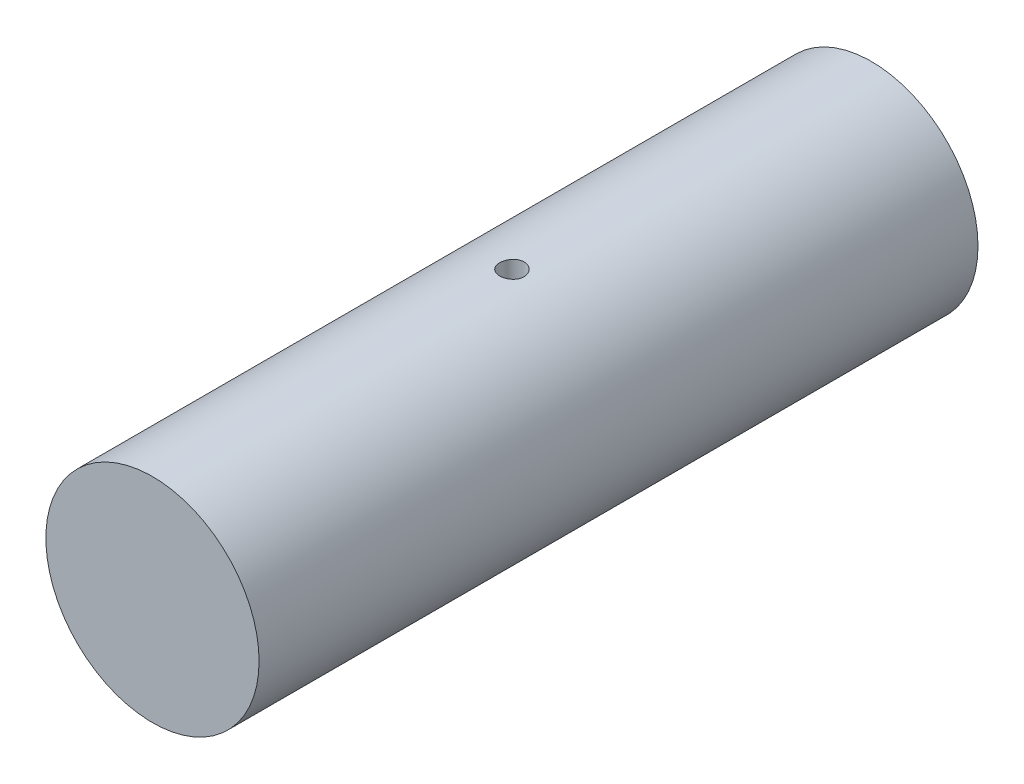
ISO-10303-21;
HEADER;
FILE_DESCRIPTION(('STEP AP214'),'2;1');
FILE_NAME('part.step','',(''),(''),'','','');
FILE_SCHEMA(('AUTOMOTIVE_DESIGN { 1 0 10303 214 1 1 1 1 }'));
ENDSEC;
DATA;
#1=APPLICATION_CONTEXT('core data for automotive mechanical design processes');
#2=APPLICATION_PROTOCOL_DEFINITION('international standard','automotive_design',2000,#1);
#3=PRODUCT_CONTEXT('',#1,'mechanical');
#4=PRODUCT('Part','Part','',(#3));
#5=PRODUCT_RELATED_PRODUCT_CATEGORY('part','',(#4));
#6=PRODUCT_DEFINITION_FORMATION('','',#4);
#7=PRODUCT_DEFINITION_CONTEXT('part definition',#1,'design');
#8=PRODUCT_DEFINITION('design','',#6,#7);
#9=PRODUCT_DEFINITION_SHAPE('','',#8);
#10=(LENGTH_UNIT() NAMED_UNIT(*) SI_UNIT(.MILLI.,.METRE.));
#11=(NAMED_UNIT(*) PLANE_ANGLE_UNIT() SI_UNIT($,.RADIAN.));
#12=(NAMED_UNIT(*) SI_UNIT($,.STERADIAN.) SOLID_ANGLE_UNIT());
#13=UNCERTAINTY_MEASURE_WITH_UNIT(LENGTH_MEASURE(1.E-05),#10,'distance_accuracy_value','');
#14=(GEOMETRIC_REPRESENTATION_CONTEXT(3) GLOBAL_UNCERTAINTY_ASSIGNED_CONTEXT((#13)) GLOBAL_UNIT_ASSIGNED_CONTEXT((#10,
#11,#12)) REPRESENTATION_CONTEXT('',''));
#15=CARTESIAN_POINT('',(0.,0.,0.));
#16=DIRECTION('',(0.,0.,1.));
#17=DIRECTION('',(1.,0.,0.));
#18=AXIS2_PLACEMENT_3D('',#15,#16,#17);
#19=CARTESIAN_POINT('',(0.,0.,118.));
#20=DIRECTION('',(0.,0.,-1.));
#21=DIRECTION('',(-1.,0.,0.));
#22=AXIS2_PLACEMENT_3D('',#19,#20,#21);
#23=CYLINDRICAL_SURFACE('',#22,17.5);
#24=CARTESIAN_POINT('',(0.,-17.5,61.));
#25=CARTESIAN_POINT('',(0.111949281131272,-17.4999985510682,60.9999951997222));
#26=CARTESIAN_POINT('',(0.223970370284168,-17.4989143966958,60.9905688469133));
#27=CARTESIAN_POINT('',(0.444900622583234,-17.4946937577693,60.9531111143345));
#28=CARTESIAN_POINT('',(0.553806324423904,-17.4915550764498,60.9250598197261));
#29=CARTESIAN_POINT('',(0.765274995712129,-17.4835792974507,60.8511849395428));
#30=CARTESIAN_POINT('',(0.867841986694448,-17.4787432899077,60.8053727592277));
#31=CARTESIAN_POINT('',(1.06381060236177,-17.4679120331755,60.6973002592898));
#32=CARTESIAN_POINT('',(1.15721390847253,-17.4619169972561,60.6350429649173));
#33=CARTESIAN_POINT('',(1.33265783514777,-17.4494069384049,60.4955382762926));
#34=CARTESIAN_POINT('',(1.41464987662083,-17.4428898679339,60.4182299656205));
#35=CARTESIAN_POINT('',(1.5645257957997,-17.4300869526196,60.2509482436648));
#36=CARTESIAN_POINT('',(1.63240898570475,-17.4238011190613,60.1609742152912));
#37=CARTESIAN_POINT('',(1.75231750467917,-17.4121519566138,59.970604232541));
#38=CARTESIAN_POINT('',(1.80429797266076,-17.4067912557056,59.870179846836));
#39=CARTESIAN_POINT('',(1.89063905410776,-17.3976257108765,59.6619560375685));
#40=CARTESIAN_POINT('',(1.92500022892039,-17.3938208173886,59.5541568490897));
#41=CARTESIAN_POINT('',(1.97498120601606,-17.3882168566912,59.3347441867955));
#42=CARTESIAN_POINT('',(1.99068245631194,-17.3864090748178,59.2231494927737));
#43=CARTESIAN_POINT('',(2.00314979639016,-17.3849772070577,58.9988954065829));
#44=CARTESIAN_POINT('',(1.99991652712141,-17.3853530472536,58.8862360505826));
#45=CARTESIAN_POINT('',(1.9746735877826,-17.3882379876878,58.6636154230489));
#46=CARTESIAN_POINT('',(1.95275327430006,-17.3907369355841,58.5536438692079));
#47=CARTESIAN_POINT('',(1.89089772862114,-17.3975706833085,58.3389506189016));
#48=CARTESIAN_POINT('',(1.85096218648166,-17.4019055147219,58.2342290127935));
#49=CARTESIAN_POINT('',(1.7541125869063,-17.4119342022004,58.0327285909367));
#50=CARTESIAN_POINT('',(1.697159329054,-17.4176311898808,57.9359687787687));
#51=CARTESIAN_POINT('',(1.5679190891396,-17.4297397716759,57.7533467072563));
#52=CARTESIAN_POINT('',(1.49563152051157,-17.4361513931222,57.6674848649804));
#53=CARTESIAN_POINT('',(1.33727766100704,-17.4490120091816,57.5085771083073));
#54=CARTESIAN_POINT('',(1.25113428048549,-17.455461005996,57.4356079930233));
#55=CARTESIAN_POINT('',(1.06778054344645,-17.4676349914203,57.3051537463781));
#56=CARTESIAN_POINT('',(0.970570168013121,-17.4733599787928,57.2476686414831));
#57=CARTESIAN_POINT('',(0.767785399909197,-17.4834436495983,57.1498155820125));
#58=CARTESIAN_POINT('',(0.662208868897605,-17.4878019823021,57.1094520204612));
#59=CARTESIAN_POINT('',(0.445716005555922,-17.4946579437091,57.0470466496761));
#60=CARTESIAN_POINT('',(0.334799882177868,-17.4971556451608,57.0250041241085));
#61=CARTESIAN_POINT('',(0.111440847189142,-17.4999995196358,56.9999651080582));
#62=CARTESIAN_POINT('',(-0.000990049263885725,-17.5003576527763,56.9968627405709));
#63=CARTESIAN_POINT('',(-0.224770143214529,-17.4989142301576,57.0095132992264));
#64=CARTESIAN_POINT('',(-0.336119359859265,-17.4971127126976,57.0252658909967));
#65=CARTESIAN_POINT('',(-0.554265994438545,-17.4915599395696,57.0750913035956));
#66=CARTESIAN_POINT('',(-0.661074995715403,-17.4878140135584,57.109114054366));
#67=CARTESIAN_POINT('',(-0.867470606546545,-17.4787921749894,57.1944622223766));
#68=CARTESIAN_POINT('',(-0.967057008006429,-17.4735162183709,57.2457881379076));
#69=CARTESIAN_POINT('',(-1.1566560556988,-17.4619935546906,57.3645447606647));
#70=CARTESIAN_POINT('',(-1.24662524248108,-17.4557427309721,57.4320444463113));
#71=CARTESIAN_POINT('',(-1.41399482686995,-17.4429836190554,57.5811343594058));
#72=CARTESIAN_POINT('',(-1.49139480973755,-17.4364753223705,57.6627250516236));
#73=CARTESIAN_POINT('',(-1.63180089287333,-17.4238982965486,57.8381453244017));
#74=CARTESIAN_POINT('',(-1.69473712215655,-17.4178317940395,57.9320310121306));
#75=CARTESIAN_POINT('',(-1.80394755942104,-17.4068606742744,58.1291019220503));
#76=CARTESIAN_POINT('',(-1.85022205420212,-17.4019560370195,58.2322869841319));
#77=CARTESIAN_POINT('',(-1.92468057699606,-17.3938786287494,58.4447957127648));
#78=CARTESIAN_POINT('',(-1.9529049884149,-17.3907019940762,58.5541050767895));
#79=CARTESIAN_POINT('',(-1.99059267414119,-17.3864287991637,58.7759500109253));
#80=CARTESIAN_POINT('',(-2.00005666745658,-17.385332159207,58.8884854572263));
#81=CARTESIAN_POINT('',(-1.99994314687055,-17.385345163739,59.1128933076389));
#82=CARTESIAN_POINT('',(-1.99047539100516,-17.3864420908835,59.2247657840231));
#83=CARTESIAN_POINT('',(-1.95299850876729,-17.3906913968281,59.445318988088));
#84=CARTESIAN_POINT('',(-1.92498937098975,-17.3938437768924,59.5539997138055));
#85=CARTESIAN_POINT('',(-1.85125733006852,-17.4018450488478,59.7650760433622));
#86=CARTESIAN_POINT('',(-1.80553879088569,-17.4066935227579,59.8674731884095));
#87=CARTESIAN_POINT('',(-1.69769666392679,-17.4175414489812,60.0631591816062));
#88=CARTESIAN_POINT('',(-1.63557300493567,-17.4235409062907,60.1564479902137));
#89=CARTESIAN_POINT('',(-1.496274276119,-17.4360565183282,60.3318311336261));
#90=CARTESIAN_POINT('',(-1.41901733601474,-17.4425753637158,60.4138602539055));
#91=CARTESIAN_POINT('',(-1.25181311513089,-17.4553710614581,60.5638342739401));
#92=CARTESIAN_POINT('',(-1.16186282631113,-17.4616478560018,60.6317758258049));
#93=CARTESIAN_POINT('',(-0.971500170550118,-17.4732739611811,60.751826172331));
#94=CARTESIAN_POINT('',(-0.871055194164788,-17.478620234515,60.8038835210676));
#95=CARTESIAN_POINT('',(-0.662847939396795,-17.4877513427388,60.8903202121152));
#96=CARTESIAN_POINT('',(-0.555093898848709,-17.4915379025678,60.9247190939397));
#97=CARTESIAN_POINT('',(-0.372298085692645,-17.4961924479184,60.9664711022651));
#98=CARTESIAN_POINT('',(-0.298416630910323,-17.4976134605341,60.9790267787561));
#99=CARTESIAN_POINT('',(-0.149700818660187,-17.499517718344,60.9957928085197));
#100=CARTESIAN_POINT('',(-0.0748664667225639,-17.5000009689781,61.0000032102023));
#101=CARTESIAN_POINT('',(0.,-17.5,61.));
#102=B_SPLINE_CURVE_WITH_KNOTS('',3,(#24,#25,#26,#27,#28,#29,#30,#31,#32,#33,#34,#35,#36,#37,
#38,#39,#40,#41,#42,#43,#44,#45,#46,#47,#48,#49,#50,#51,#52,#53,#54,#55,#56,#57,#58,#59,#60,#61,
#62,#63,#64,#65,#66,#67,#68,#69,#70,#71,#72,#73,#74,#75,#76,#77,#78,#79,#80,#81,#82,#83,#84,#85,
#86,#87,#88,#89,#90,#91,#92,#93,#94,#95,#96,#97,#98,#99,#100,#101),.UNSPECIFIED.,.T.,.F.,(4,2,2,
2,2,2,2,2,2,2,2,2,2,2,2,2,2,2,2,2,2,2,2,2,2,2,2,2,2,2,2,2,2,2,2,2,2,2,4),(0.,0.33557441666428,
0.671508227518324,1.00722667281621,1.34288340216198,1.67992799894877,2.01698902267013,
2.35499229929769,2.69298480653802,3.02949654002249,3.36599688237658,3.70089713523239,
4.03580315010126,4.37148664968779,4.7071829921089,5.04481612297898,5.38244983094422,
5.72017011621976,6.05787719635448,6.39369472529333,6.7295062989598,7.06440223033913,
7.39930780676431,7.73566795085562,8.07203919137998,8.41000271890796,8.74796042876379,
9.08515935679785,9.42234536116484,9.75758217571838,10.0928191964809,10.4279736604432,
10.763129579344,11.100151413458,11.4372532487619,11.7754355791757,12.1132428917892,
12.3376607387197,12.5620772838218),.UNSPECIFIED.);
#103=CARTESIAN_POINT('',(0.,-17.5,61.));
#104=VERTEX_POINT('',#103);
#105=EDGE_CURVE('E10',#104,#104,#102,.T.);
#106=ORIENTED_EDGE('',*,*,#105,.T.);
#107=EDGE_LOOP('',(#106));
#108=FACE_BOUND('',#107,.T.);
#109=CARTESIAN_POINT('',(0.,17.5,61.));
#110=CARTESIAN_POINT('',(-0.111949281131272,17.4999985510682,60.9999951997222));
#111=CARTESIAN_POINT('',(-0.223970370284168,17.4989143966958,60.9905688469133));
#112=CARTESIAN_POINT('',(-0.444900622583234,17.4946937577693,60.9531111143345));
#113=CARTESIAN_POINT('',(-0.553806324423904,17.4915550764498,60.9250598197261));
#114=CARTESIAN_POINT('',(-0.765274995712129,17.4835792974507,60.8511849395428));
#115=CARTESIAN_POINT('',(-0.867841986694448,17.4787432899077,60.8053727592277));
#116=CARTESIAN_POINT('',(-1.06381060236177,17.4679120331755,60.6973002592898));
#117=CARTESIAN_POINT('',(-1.15721390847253,17.4619169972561,60.6350429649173));
#118=CARTESIAN_POINT('',(-1.33265783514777,17.4494069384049,60.4955382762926));
#119=CARTESIAN_POINT('',(-1.41464987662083,17.4428898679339,60.4182299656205));
#120=CARTESIAN_POINT('',(-1.5645257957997,17.4300869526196,60.2509482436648));
#121=CARTESIAN_POINT('',(-1.63240898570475,17.4238011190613,60.1609742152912));
#122=CARTESIAN_POINT('',(-1.75231750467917,17.4121519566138,59.970604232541));
#123=CARTESIAN_POINT('',(-1.80429797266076,17.4067912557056,59.870179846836));
#124=CARTESIAN_POINT('',(-1.89063905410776,17.3976257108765,59.6619560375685));
#125=CARTESIAN_POINT('',(-1.92500022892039,17.3938208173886,59.5541568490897));
#126=CARTESIAN_POINT('',(-1.97498120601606,17.3882168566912,59.3347441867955));
#127=CARTESIAN_POINT('',(-1.99068245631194,17.3864090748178,59.2231494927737));
#128=CARTESIAN_POINT('',(-2.00314979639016,17.3849772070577,58.9988954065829));
#129=CARTESIAN_POINT('',(-1.99991652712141,17.3853530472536,58.8862360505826));
#130=CARTESIAN_POINT('',(-1.9746735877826,17.3882379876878,58.6636154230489));
#131=CARTESIAN_POINT('',(-1.95275327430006,17.3907369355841,58.5536438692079));
#132=CARTESIAN_POINT('',(-1.89089772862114,17.3975706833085,58.3389506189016));
#133=CARTESIAN_POINT('',(-1.85096218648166,17.4019055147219,58.2342290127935));
#134=CARTESIAN_POINT('',(-1.7541125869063,17.4119342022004,58.0327285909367));
#135=CARTESIAN_POINT('',(-1.697159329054,17.4176311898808,57.9359687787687));
#136=CARTESIAN_POINT('',(-1.5679190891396,17.4297397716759,57.7533467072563));
#137=CARTESIAN_POINT('',(-1.49563152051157,17.4361513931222,57.6674848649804));
#138=CARTESIAN_POINT('',(-1.33727766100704,17.4490120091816,57.5085771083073));
#139=CARTESIAN_POINT('',(-1.25113428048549,17.455461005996,57.4356079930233));
#140=CARTESIAN_POINT('',(-1.06778054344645,17.4676349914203,57.3051537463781));
#141=CARTESIAN_POINT('',(-0.970570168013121,17.4733599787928,57.2476686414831));
#142=CARTESIAN_POINT('',(-0.767785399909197,17.4834436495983,57.1498155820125));
#143=CARTESIAN_POINT('',(-0.662208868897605,17.4878019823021,57.1094520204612));
#144=CARTESIAN_POINT('',(-0.445716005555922,17.4946579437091,57.0470466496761));
#145=CARTESIAN_POINT('',(-0.334799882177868,17.4971556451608,57.0250041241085));
#146=CARTESIAN_POINT('',(-0.111440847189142,17.4999995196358,56.9999651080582));
#147=CARTESIAN_POINT('',(0.000990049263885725,17.5003576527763,56.9968627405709));
#148=CARTESIAN_POINT('',(0.224770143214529,17.4989142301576,57.0095132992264));
#149=CARTESIAN_POINT('',(0.336119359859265,17.4971127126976,57.0252658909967));
#150=CARTESIAN_POINT('',(0.554265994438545,17.4915599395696,57.0750913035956));
#151=CARTESIAN_POINT('',(0.661074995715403,17.4878140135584,57.109114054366));
#152=CARTESIAN_POINT('',(0.867470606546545,17.4787921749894,57.1944622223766));
#153=CARTESIAN_POINT('',(0.967057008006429,17.4735162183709,57.2457881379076));
#154=CARTESIAN_POINT('',(1.1566560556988,17.4619935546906,57.3645447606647));
#155=CARTESIAN_POINT('',(1.24662524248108,17.4557427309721,57.4320444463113));
#156=CARTESIAN_POINT('',(1.41399482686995,17.4429836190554,57.5811343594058));
#157=CARTESIAN_POINT('',(1.49139480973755,17.4364753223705,57.6627250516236));
#158=CARTESIAN_POINT('',(1.63180089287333,17.4238982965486,57.8381453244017));
#159=CARTESIAN_POINT('',(1.69473712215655,17.4178317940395,57.9320310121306));
#160=CARTESIAN_POINT('',(1.80394755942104,17.4068606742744,58.1291019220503));
#161=CARTESIAN_POINT('',(1.85022205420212,17.4019560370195,58.2322869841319));
#162=CARTESIAN_POINT('',(1.92468057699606,17.3938786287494,58.4447957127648));
#163=CARTESIAN_POINT('',(1.9529049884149,17.3907019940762,58.5541050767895));
#164=CARTESIAN_POINT('',(1.99059267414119,17.3864287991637,58.7759500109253));
#165=CARTESIAN_POINT('',(2.00005666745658,17.385332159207,58.8884854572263));
#166=CARTESIAN_POINT('',(1.99994314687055,17.385345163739,59.1128933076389));
#167=CARTESIAN_POINT('',(1.99047539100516,17.3864420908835,59.2247657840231));
#168=CARTESIAN_POINT('',(1.95299850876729,17.3906913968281,59.445318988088));
#169=CARTESIAN_POINT('',(1.92498937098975,17.3938437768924,59.5539997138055));
#170=CARTESIAN_POINT('',(1.85125733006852,17.4018450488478,59.7650760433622));
#171=CARTESIAN_POINT('',(1.80553879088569,17.4066935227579,59.8674731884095));
#172=CARTESIAN_POINT('',(1.69769666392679,17.4175414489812,60.0631591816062));
#173=CARTESIAN_POINT('',(1.63557300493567,17.4235409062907,60.1564479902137));
#174=CARTESIAN_POINT('',(1.496274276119,17.4360565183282,60.3318311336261));
#175=CARTESIAN_POINT('',(1.41901733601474,17.4425753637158,60.4138602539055));
#176=CARTESIAN_POINT('',(1.25181311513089,17.4553710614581,60.5638342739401));
#177=CARTESIAN_POINT('',(1.16186282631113,17.4616478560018,60.6317758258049));
#178=CARTESIAN_POINT('',(0.971500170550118,17.4732739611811,60.751826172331));
#179=CARTESIAN_POINT('',(0.871055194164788,17.478620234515,60.8038835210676));
#180=CARTESIAN_POINT('',(0.662847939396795,17.4877513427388,60.8903202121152));
#181=CARTESIAN_POINT('',(0.555093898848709,17.4915379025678,60.9247190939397));
#182=CARTESIAN_POINT('',(0.372298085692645,17.4961924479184,60.9664711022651));
#183=CARTESIAN_POINT('',(0.298416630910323,17.4976134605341,60.9790267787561));
#184=CARTESIAN_POINT('',(0.149700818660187,17.499517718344,60.9957928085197));
#185=CARTESIAN_POINT('',(0.0748664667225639,17.5000009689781,61.0000032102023));
#186=CARTESIAN_POINT('',(0.,17.5,61.));
#187=B_SPLINE_CURVE_WITH_KNOTS('',3,(#109,#110,#111,#112,#113,#114,#115,#116,#117,#118,#119,
#120,#121,#122,#123,#124,#125,#126,#127,#128,#129,#130,#131,#132,#133,#134,#135,#136,#137,#138,
#139,#140,#141,#142,#143,#144,#145,#146,#147,#148,#149,#150,#151,#152,#153,#154,#155,#156,#157,
#158,#159,#160,#161,#162,#163,#164,#165,#166,#167,#168,#169,#170,#171,#172,#173,#174,#175,#176,
#177,#178,#179,#180,#181,#182,#183,#184,#185,#186),.UNSPECIFIED.,.T.,.F.,(4,2,2,2,2,2,2,2,2,2,2,
2,2,2,2,2,2,2,2,2,2,2,2,2,2,2,2,2,2,2,2,2,2,2,2,2,2,2,4),(0.,0.33557441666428,0.671508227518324,
1.00722667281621,1.34288340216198,1.67992799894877,2.01698902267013,2.35499229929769,
2.69298480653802,3.02949654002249,3.36599688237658,3.70089713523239,4.03580315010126,
4.37148664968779,4.7071829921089,5.04481612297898,5.38244983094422,5.72017011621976,
6.05787719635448,6.39369472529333,6.7295062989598,7.06440223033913,7.39930780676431,
7.73566795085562,8.07203919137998,8.41000271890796,8.74796042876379,9.08515935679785,
9.42234536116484,9.75758217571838,10.0928191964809,10.4279736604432,10.763129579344,
11.100151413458,11.4372532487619,11.7754355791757,12.1132428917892,12.3376607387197,
12.5620772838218),.UNSPECIFIED.);
#188=CARTESIAN_POINT('',(0.,17.5,61.));
#189=VERTEX_POINT('',#188);
#190=EDGE_CURVE('E43',#189,#189,#187,.T.);
#191=ORIENTED_EDGE('',*,*,#190,.T.);
#192=EDGE_LOOP('',(#191));
#193=FACE_BOUND('',#192,.T.);
#194=CARTESIAN_POINT('',(0.,0.,118.));
#195=DIRECTION('',(0.,0.,1.));
#196=DIRECTION('',(1.,0.,0.));
#197=AXIS2_PLACEMENT_3D('',#194,#195,#196);
#198=CIRCLE('',#197,17.5);
#199=CARTESIAN_POINT('',(17.5,0.,118.));
#200=VERTEX_POINT('',#199);
#201=EDGE_CURVE('E47',#200,#200,#198,.T.);
#202=ORIENTED_EDGE('',*,*,#201,.F.);
#203=EDGE_LOOP('',(#202));
#204=FACE_BOUND('',#203,.T.);
#205=CARTESIAN_POINT('',(0.,0.,0.));
#206=DIRECTION('',(0.,0.,1.));
#207=DIRECTION('',(1.,0.,0.));
#208=AXIS2_PLACEMENT_3D('',#205,#206,#207);
#209=CIRCLE('',#208,17.5);
#210=CARTESIAN_POINT('',(17.5,0.,0.));
#211=VERTEX_POINT('',#210);
#212=EDGE_CURVE('E51',#211,#211,#209,.T.);
#213=ORIENTED_EDGE('',*,*,#212,.T.);
#214=EDGE_LOOP('',(#213));
#215=FACE_BOUND('',#214,.T.);
#216=ADVANCED_FACE('F33',(#108,#193,#204,#215),#23,.T.);
#217=CARTESIAN_POINT('',(0.,0.,118.));
#218=DIRECTION('',(0.,0.,1.));
#219=DIRECTION('',(1.,0.,0.));
#220=AXIS2_PLACEMENT_3D('',#217,#218,#219);
#221=PLANE('',#220);
#222=ORIENTED_EDGE('',*,*,#201,.T.);
#223=EDGE_LOOP('',(#222));
#224=FACE_BOUND('',#223,.T.);
#225=ADVANCED_FACE('F62',(#224),#221,.T.);
#226=CARTESIAN_POINT('',(0.,0.,0.));
#227=DIRECTION('',(0.,0.,1.));
#228=DIRECTION('',(1.,0.,0.));
#229=AXIS2_PLACEMENT_3D('',#226,#227,#228);
#230=PLANE('',#229);
#231=ORIENTED_EDGE('',*,*,#212,.F.);
#232=EDGE_LOOP('',(#231));
#233=FACE_BOUND('',#232,.T.);
#234=ADVANCED_FACE('F60',(#233),#230,.F.);
#235=CARTESIAN_POINT('',(0.,-17.5,59.));
#236=DIRECTION('',(0.,1.,0.));
#237=DIRECTION('',(0.,0.,1.));
#238=AXIS2_PLACEMENT_3D('',#235,#236,#237);
#239=CYLINDRICAL_SURFACE('',#238,2.);
#240=ORIENTED_EDGE('',*,*,#190,.F.);
#241=EDGE_LOOP('',(#240));
#242=FACE_BOUND('',#241,.T.);
#243=ORIENTED_EDGE('',*,*,#105,.F.);
#244=EDGE_LOOP('',(#243));
#245=FACE_BOUND('',#244,.T.);
#246=ADVANCED_FACE('F56',(#242,#245),#239,.F.);
#247=CLOSED_SHELL('',(#216,#225,#234,#246));
#248=MANIFOLD_SOLID_BREP('B2',#247);
#249=ADVANCED_BREP_SHAPE_REPRESENTATION('',(#18,#248),#14);
#250=SHAPE_DEFINITION_REPRESENTATION(#9,#249);
ENDSEC;
END-ISO-10303-21;
